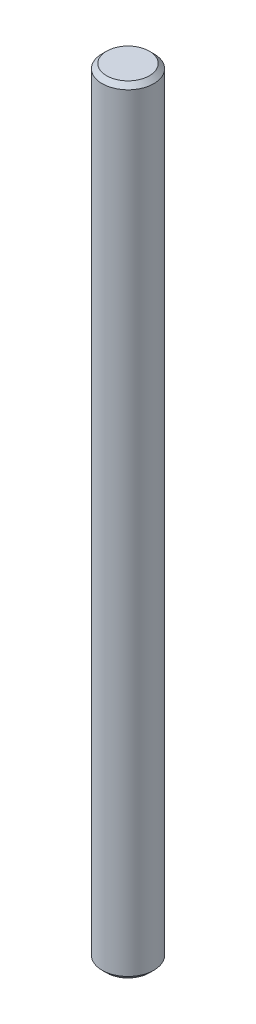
from build123d import *

# Parameters (mm, degrees)
SKETCH1_R           = 2
BOSS_EXTRUDE1_DEPTH = 60
CHAMFER1_SIZE       = 0.35


with BuildPart() as part:
    # Sketch1 → Boss-Extrude1 (new body)
    with BuildSketch(Plane(origin=(0, 0, 0), x_dir=(1, 0, 0), z_dir=(0, 1, 0))):
        with Locations(Location((0, 0, 0), (0, 0, 270))):
            Circle(SKETCH1_R)
    extrude(amount=BOSS_EXTRUDE1_DEPTH)

    # Chamfer1
    chamfer1_edges = [part.edges().sort_by_distance(p)[0] for p in [
        (0, 0, -2),
        (0, 60, -2),
    ]]
    chamfer(chamfer1_edges, length=CHAMFER1_SIZE)


solid = part.part
